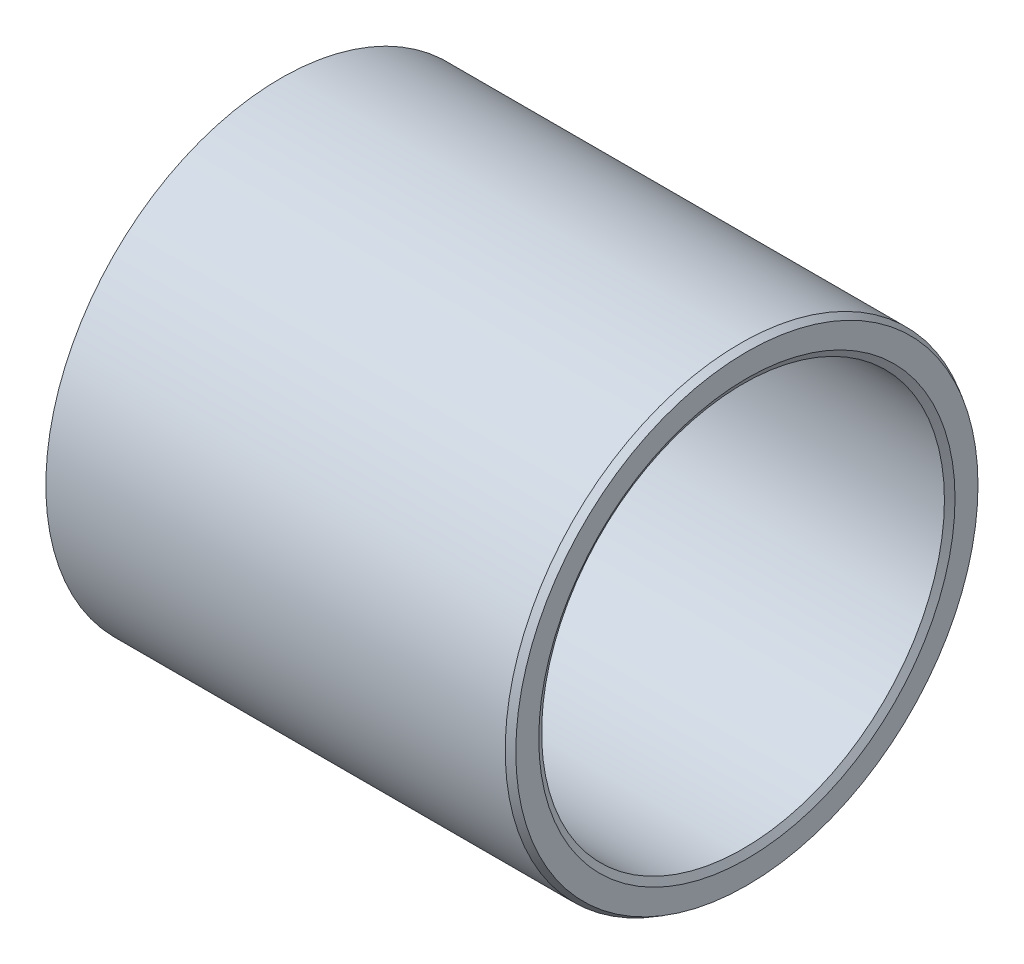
from build123d import *
from OCP.BRepFilletAPI import BRepFilletAPI_MakeChamfer

# Parameters (mm, degrees)
SKETCH1_R           = 3.5
SKETCH1_R_2         = 3
BOSS_EXTRUDE1_DEPTH = 3.5
CHAMFER1_SIZE       = 0.1
CHAMFER1_SIZE2      = 0.057735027


with BuildPart() as part:
    # Sketch1 → Boss-Extrude1 (new, symmetric)
    with BuildSketch(Plane(origin=(0, 0, 0), x_dir=(0, 0, -1), z_dir=(1, 0, 0))):
        Circle(SKETCH1_R)
        Circle(SKETCH1_R_2, mode=Mode.SUBTRACT)
    extrude(amount=BOSS_EXTRUDE1_DEPTH, both=True)

    # Chamfer1: one chamfer whose edges measure the first distance from different faces: ONE call of the kernel's chamfer builder (chamfer() names one face for all edges)
    chamfer1_edges_1 = [part.edges().sort_by_distance(p)[0] for p in [
        (-3.5, 0, 3.5),
    ]]
    chamfer1_side_1 = [part.faces().sort_by_distance(p)[0] for p in [
        (-3.5, 0, 3.401005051),
    ]]
    chamfer1_edges_2 = [part.edges().sort_by_distance(p)[0] for p in [
        (3.5, 0, 3.5),
    ]]
    chamfer1_side_2 = [part.faces().sort_by_distance(p)[0] for p in [
        (0, 0, 3.5),
    ]]
    chamfer1_edges_3 = [part.edges().sort_by_distance(p)[0] for p in [
        (-3.5, 0, 3),
    ]]
    chamfer1_side_3 = [part.faces().sort_by_distance(p)[0] for p in [
        (0, 0, 3),
    ]]
    chamfer1_edges_4 = [part.edges().sort_by_distance(p)[0] for p in [
        (3.5, 0, 3),
    ]]
    chamfer1_side_4 = [part.faces().sort_by_distance(p)[0] for p in [
        (3.5, 0, 3.401005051),
    ]]
    chamfer1 = BRepFilletAPI_MakeChamfer(part.part.solid().wrapped)
    for e in chamfer1_edges_1:
        chamfer1.Add(CHAMFER1_SIZE, CHAMFER1_SIZE2, e.wrapped, chamfer1_side_1[0].wrapped)  # the first distance lies on this face
    for e in chamfer1_edges_2:
        chamfer1.Add(CHAMFER1_SIZE, CHAMFER1_SIZE2, e.wrapped, chamfer1_side_2[0].wrapped)  # the first distance lies on this face
    for e in chamfer1_edges_3:
        chamfer1.Add(CHAMFER1_SIZE, CHAMFER1_SIZE2, e.wrapped, chamfer1_side_3[0].wrapped)  # the first distance lies on this face
    for e in chamfer1_edges_4:
        chamfer1.Add(CHAMFER1_SIZE, CHAMFER1_SIZE2, e.wrapped, chamfer1_side_4[0].wrapped)  # the first distance lies on this face
    add(Compound.cast(chamfer1.Shape()), mode=Mode.REPLACE)


solid = part.part
